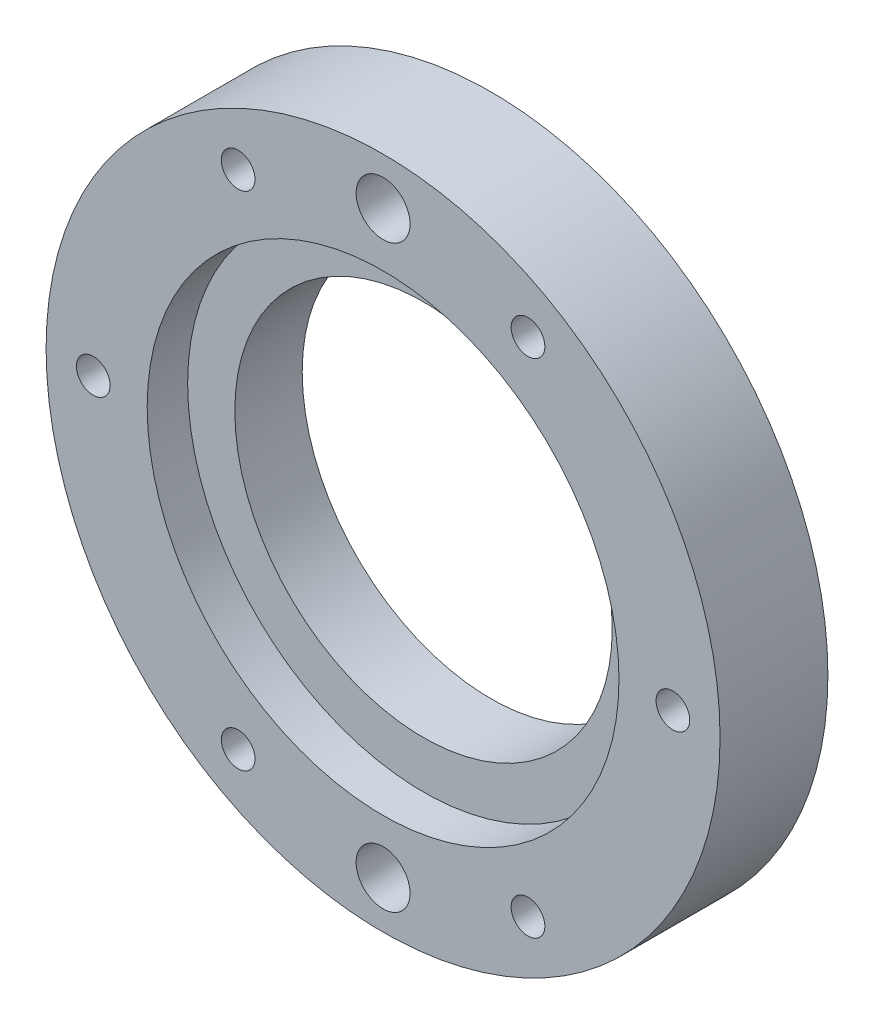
ISO-10303-21;
HEADER;
FILE_DESCRIPTION(('STEP AP214'),'2;1');
FILE_NAME('part.step','',(''),(''),'','','');
FILE_SCHEMA(('AUTOMOTIVE_DESIGN { 1 0 10303 214 1 1 1 1 }'));
ENDSEC;
DATA;
#1=APPLICATION_CONTEXT('core data for automotive mechanical design processes');
#2=APPLICATION_PROTOCOL_DEFINITION('international standard','automotive_design',2000,#1);
#3=PRODUCT_CONTEXT('',#1,'mechanical');
#4=PRODUCT('Part','Part','',(#3));
#5=PRODUCT_RELATED_PRODUCT_CATEGORY('part','',(#4));
#6=PRODUCT_DEFINITION_FORMATION('','',#4);
#7=PRODUCT_DEFINITION_CONTEXT('part definition',#1,'design');
#8=PRODUCT_DEFINITION('design','',#6,#7);
#9=PRODUCT_DEFINITION_SHAPE('','',#8);
#10=(LENGTH_UNIT() NAMED_UNIT(*) SI_UNIT(.MILLI.,.METRE.));
#11=(NAMED_UNIT(*) PLANE_ANGLE_UNIT() SI_UNIT($,.RADIAN.));
#12=(NAMED_UNIT(*) SI_UNIT($,.STERADIAN.) SOLID_ANGLE_UNIT());
#13=UNCERTAINTY_MEASURE_WITH_UNIT(LENGTH_MEASURE(1.E-05),#10,'distance_accuracy_value','');
#14=(GEOMETRIC_REPRESENTATION_CONTEXT(3) GLOBAL_UNCERTAINTY_ASSIGNED_CONTEXT((#13)) GLOBAL_UNIT_ASSIGNED_CONTEXT((#10,
#11,#12)) REPRESENTATION_CONTEXT('',''));
#15=CARTESIAN_POINT('',(0.,0.,0.));
#16=DIRECTION('',(0.,0.,1.));
#17=DIRECTION('',(1.,0.,0.));
#18=AXIS2_PLACEMENT_3D('',#15,#16,#17);
#19=CARTESIAN_POINT('',(0.,-21.5,2.));
#20=DIRECTION('',(0.,0.,1.));
#21=DIRECTION('',(1.,0.,0.));
#22=AXIS2_PLACEMENT_3D('',#19,#20,#21);
#23=PLANE('',#22);
#24=CARTESIAN_POINT('',(0.,-21.5,2.));
#25=DIRECTION('',(0.,0.,1.));
#26=DIRECTION('',(1.,0.,0.));
#27=AXIS2_PLACEMENT_3D('',#24,#25,#26);
#28=CIRCLE('',#27,2.);
#29=CARTESIAN_POINT('',(2.,-21.5,2.));
#30=VERTEX_POINT('',#29);
#31=EDGE_CURVE('E17',#30,#30,#28,.T.);
#32=ORIENTED_EDGE('',*,*,#31,.T.);
#33=EDGE_LOOP('',(#32));
#34=FACE_BOUND('',#33,.T.);
#35=ADVANCED_FACE('F14',(#34),#23,.T.);
#36=CARTESIAN_POINT('',(0.,21.5,2.));
#37=DIRECTION('',(0.,0.,1.));
#38=DIRECTION('',(1.,0.,0.));
#39=AXIS2_PLACEMENT_3D('',#36,#37,#38);
#40=PLANE('',#39);
#41=CARTESIAN_POINT('',(0.,21.5,2.));
#42=DIRECTION('',(0.,0.,1.));
#43=DIRECTION('',(1.,0.,0.));
#44=AXIS2_PLACEMENT_3D('',#41,#42,#43);
#45=CIRCLE('',#44,2.);
#46=CARTESIAN_POINT('',(2.,21.5,2.));
#47=VERTEX_POINT('',#46);
#48=EDGE_CURVE('E81',#47,#47,#45,.T.);
#49=ORIENTED_EDGE('',*,*,#48,.T.);
#50=EDGE_LOOP('',(#49));
#51=FACE_BOUND('',#50,.T.);
#52=ADVANCED_FACE('F92',(#51),#40,.T.);
#53=CARTESIAN_POINT('',(0.,-21.5,2.));
#54=DIRECTION('',(0.,0.,1.));
#55=DIRECTION('',(1.,0.,0.));
#56=AXIS2_PLACEMENT_3D('',#53,#54,#55);
#57=CYLINDRICAL_SURFACE('',#56,2.);
#58=CARTESIAN_POINT('',(0.,-21.5,8.));
#59=DIRECTION('',(0.,0.,1.));
#60=DIRECTION('',(1.,0.,0.));
#61=AXIS2_PLACEMENT_3D('',#58,#59,#60);
#62=CIRCLE('',#61,2.);
#63=CARTESIAN_POINT('',(2.,-21.5,8.));
#64=VERTEX_POINT('',#63);
#65=EDGE_CURVE('E79',#64,#64,#62,.F.);
#66=ORIENTED_EDGE('',*,*,#65,.F.);
#67=EDGE_LOOP('',(#66));
#68=FACE_BOUND('',#67,.T.);
#69=ORIENTED_EDGE('',*,*,#31,.F.);
#70=EDGE_LOOP('',(#69));
#71=FACE_BOUND('',#70,.T.);
#72=ADVANCED_FACE('F89',(#68,#71),#57,.F.);
#73=CARTESIAN_POINT('',(0.,21.5,2.));
#74=DIRECTION('',(0.,0.,1.));
#75=DIRECTION('',(1.,0.,0.));
#76=AXIS2_PLACEMENT_3D('',#73,#74,#75);
#77=CYLINDRICAL_SURFACE('',#76,2.);
#78=CARTESIAN_POINT('',(0.,21.5,8.));
#79=DIRECTION('',(0.,0.,1.));
#80=DIRECTION('',(1.,0.,0.));
#81=AXIS2_PLACEMENT_3D('',#78,#79,#80);
#82=CIRCLE('',#81,2.);
#83=CARTESIAN_POINT('',(2.,21.5,8.));
#84=VERTEX_POINT('',#83);
#85=EDGE_CURVE('E76',#84,#84,#82,.F.);
#86=ORIENTED_EDGE('',*,*,#85,.F.);
#87=EDGE_LOOP('',(#86));
#88=FACE_BOUND('',#87,.T.);
#89=ORIENTED_EDGE('',*,*,#48,.F.);
#90=EDGE_LOOP('',(#89));
#91=FACE_BOUND('',#90,.T.);
#92=ADVANCED_FACE('F91',(#88,#91),#77,.F.);
#93=CARTESIAN_POINT('',(0.,0.,8.));
#94=DIRECTION('',(0.,0.,-1.));
#95=DIRECTION('',(-1.,0.,0.));
#96=AXIS2_PLACEMENT_3D('',#93,#94,#95);
#97=CYLINDRICAL_SURFACE('',#96,17.5);
#98=CARTESIAN_POINT('',(0.,0.,8.));
#99=DIRECTION('',(0.,0.,-1.));
#100=DIRECTION('',(-1.,0.,0.));
#101=AXIS2_PLACEMENT_3D('',#98,#99,#100);
#102=CIRCLE('',#101,17.5);
#103=CARTESIAN_POINT('',(-17.5,0.,8.));
#104=VERTEX_POINT('',#103);
#105=EDGE_CURVE('E73',#104,#104,#102,.T.);
#106=ORIENTED_EDGE('',*,*,#105,.F.);
#107=EDGE_LOOP('',(#106));
#108=FACE_BOUND('',#107,.T.);
#109=CARTESIAN_POINT('',(0.,0.,5.));
#110=DIRECTION('',(0.,0.,-1.));
#111=DIRECTION('',(-1.,0.,0.));
#112=AXIS2_PLACEMENT_3D('',#109,#110,#111);
#113=CIRCLE('',#112,17.5);
#114=CARTESIAN_POINT('',(-17.5,0.,5.));
#115=VERTEX_POINT('',#114);
#116=EDGE_CURVE('E70',#115,#115,#113,.F.);
#117=ORIENTED_EDGE('',*,*,#116,.F.);
#118=EDGE_LOOP('',(#117));
#119=FACE_BOUND('',#118,.T.);
#120=ADVANCED_FACE('F100',(#108,#119),#97,.F.);
#121=CARTESIAN_POINT('',(0.,0.,8.));
#122=DIRECTION('',(0.,0.,1.));
#123=DIRECTION('',(1.,0.,0.));
#124=AXIS2_PLACEMENT_3D('',#121,#122,#123);
#125=PLANE('',#124);
#126=ORIENTED_EDGE('',*,*,#105,.T.);
#127=EDGE_LOOP('',(#126));
#128=FACE_BOUND('',#127,.T.);
#129=CARTESIAN_POINT('',(0.,0.,8.));
#130=DIRECTION('',(0.,0.,-1.));
#131=DIRECTION('',(-1.,0.,0.));
#132=AXIS2_PLACEMENT_3D('',#129,#130,#131);
#133=CIRCLE('',#132,25.);
#134=CARTESIAN_POINT('',(-25.,0.,8.));
#135=VERTEX_POINT('',#134);
#136=EDGE_CURVE('E49',#135,#135,#133,.T.);
#137=ORIENTED_EDGE('',*,*,#136,.F.);
#138=EDGE_LOOP('',(#137));
#139=FACE_BOUND('',#138,.T.);
#140=ORIENTED_EDGE('',*,*,#85,.T.);
#141=EDGE_LOOP('',(#140));
#142=FACE_BOUND('',#141,.T.);
#143=ORIENTED_EDGE('',*,*,#65,.T.);
#144=EDGE_LOOP('',(#143));
#145=FACE_BOUND('',#144,.T.);
#146=CARTESIAN_POINT('',(-21.5,0.,8.));
#147=DIRECTION('',(0.,0.,1.));
#148=DIRECTION('',(1.,0.,0.));
#149=AXIS2_PLACEMENT_3D('',#146,#147,#148);
#150=CIRCLE('',#149,1.24999999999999);
#151=CARTESIAN_POINT('',(-20.25,0.,8.));
#152=VERTEX_POINT('',#151);
#153=EDGE_CURVE('E52',#152,#152,#150,.F.);
#154=ORIENTED_EDGE('',*,*,#153,.T.);
#155=EDGE_LOOP('',(#154));
#156=FACE_BOUND('',#155,.T.);
#157=CARTESIAN_POINT('',(-10.75,-18.6195461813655,8.));
#158=DIRECTION('',(0.,0.,1.));
#159=DIRECTION('',(1.,0.,0.));
#160=AXIS2_PLACEMENT_3D('',#157,#158,#159);
#161=CIRCLE('',#160,1.24999999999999);
#162=CARTESIAN_POINT('',(-9.50000000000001,-18.6195461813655,8.));
#163=VERTEX_POINT('',#162);
#164=EDGE_CURVE('E55',#163,#163,#161,.F.);
#165=ORIENTED_EDGE('',*,*,#164,.T.);
#166=EDGE_LOOP('',(#165));
#167=FACE_BOUND('',#166,.T.);
#168=CARTESIAN_POINT('',(10.75,-18.6195461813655,8.));
#169=DIRECTION('',(0.,0.,1.));
#170=DIRECTION('',(1.,0.,0.));
#171=AXIS2_PLACEMENT_3D('',#168,#169,#170);
#172=CIRCLE('',#171,1.24999999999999);
#173=CARTESIAN_POINT('',(12.,-18.6195461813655,8.));
#174=VERTEX_POINT('',#173);
#175=EDGE_CURVE('E58',#174,#174,#172,.F.);
#176=ORIENTED_EDGE('',*,*,#175,.T.);
#177=EDGE_LOOP('',(#176));
#178=FACE_BOUND('',#177,.T.);
#179=CARTESIAN_POINT('',(21.5,0.,8.));
#180=DIRECTION('',(0.,0.,1.));
#181=DIRECTION('',(1.,0.,0.));
#182=AXIS2_PLACEMENT_3D('',#179,#180,#181);
#183=CIRCLE('',#182,1.24999999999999);
#184=CARTESIAN_POINT('',(22.75,0.,8.));
#185=VERTEX_POINT('',#184);
#186=EDGE_CURVE('E61',#185,#185,#183,.F.);
#187=ORIENTED_EDGE('',*,*,#186,.T.);
#188=EDGE_LOOP('',(#187));
#189=FACE_BOUND('',#188,.T.);
#190=CARTESIAN_POINT('',(10.75,18.6195461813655,8.));
#191=DIRECTION('',(0.,0.,1.));
#192=DIRECTION('',(1.,0.,0.));
#193=AXIS2_PLACEMENT_3D('',#190,#191,#192);
#194=CIRCLE('',#193,1.24999999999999);
#195=CARTESIAN_POINT('',(12.,18.6195461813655,8.));
#196=VERTEX_POINT('',#195);
#197=EDGE_CURVE('E64',#196,#196,#194,.F.);
#198=ORIENTED_EDGE('',*,*,#197,.T.);
#199=EDGE_LOOP('',(#198));
#200=FACE_BOUND('',#199,.T.);
#201=CARTESIAN_POINT('',(-10.75,18.6195461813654,8.));
#202=DIRECTION('',(0.,0.,1.));
#203=DIRECTION('',(1.,0.,0.));
#204=AXIS2_PLACEMENT_3D('',#201,#202,#203);
#205=CIRCLE('',#204,1.24999999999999);
#206=CARTESIAN_POINT('',(-9.50000000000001,18.6195461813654,8.));
#207=VERTEX_POINT('',#206);
#208=EDGE_CURVE('E67',#207,#207,#205,.F.);
#209=ORIENTED_EDGE('',*,*,#208,.T.);
#210=EDGE_LOOP('',(#209));
#211=FACE_BOUND('',#210,.T.);
#212=ADVANCED_FACE('F146',(#128,#139,#142,#145,#156,#167,#178,#189,#200,#211),#125,.T.);
#213=CARTESIAN_POINT('',(0.,0.,5.));
#214=DIRECTION('',(0.,0.,1.));
#215=DIRECTION('',(1.,0.,0.));
#216=AXIS2_PLACEMENT_3D('',#213,#214,#215);
#217=PLANE('',#216);
#218=CARTESIAN_POINT('',(0.,0.,5.));
#219=DIRECTION('',(0.,0.,-1.));
#220=DIRECTION('',(-1.,0.,0.));
#221=AXIS2_PLACEMENT_3D('',#218,#219,#220);
#222=CIRCLE('',#221,14.);
#223=CARTESIAN_POINT('',(-14.,0.,5.));
#224=VERTEX_POINT('',#223);
#225=EDGE_CURVE('E46',#224,#224,#222,.T.);
#226=ORIENTED_EDGE('',*,*,#225,.T.);
#227=EDGE_LOOP('',(#226));
#228=FACE_BOUND('',#227,.T.);
#229=ORIENTED_EDGE('',*,*,#116,.T.);
#230=EDGE_LOOP('',(#229));
#231=FACE_BOUND('',#230,.T.);
#232=ADVANCED_FACE('F142',(#228,#231),#217,.T.);
#233=CARTESIAN_POINT('',(-10.75,18.6195461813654,8.));
#234=DIRECTION('',(0.,0.,1.));
#235=DIRECTION('',(1.,0.,0.));
#236=AXIS2_PLACEMENT_3D('',#233,#234,#235);
#237=CYLINDRICAL_SURFACE('',#236,1.24999999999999);
#238=CARTESIAN_POINT('',(-10.75,18.6195461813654,0.));
#239=DIRECTION('',(0.,0.,1.));
#240=DIRECTION('',(1.,0.,0.));
#241=AXIS2_PLACEMENT_3D('',#238,#239,#240);
#242=CIRCLE('',#241,1.24999999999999);
#243=CARTESIAN_POINT('',(-9.50000000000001,18.6195461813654,0.));
#244=VERTEX_POINT('',#243);
#245=EDGE_CURVE('E43',#244,#244,#242,.F.);
#246=ORIENTED_EDGE('',*,*,#245,.T.);
#247=EDGE_LOOP('',(#246));
#248=FACE_BOUND('',#247,.T.);
#249=ORIENTED_EDGE('',*,*,#208,.F.);
#250=EDGE_LOOP('',(#249));
#251=FACE_BOUND('',#250,.T.);
#252=ADVANCED_FACE('F138',(#248,#251),#237,.F.);
#253=CARTESIAN_POINT('',(10.75,18.6195461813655,8.));
#254=DIRECTION('',(0.,0.,1.));
#255=DIRECTION('',(1.,0.,0.));
#256=AXIS2_PLACEMENT_3D('',#253,#254,#255);
#257=CYLINDRICAL_SURFACE('',#256,1.24999999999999);
#258=CARTESIAN_POINT('',(10.75,18.6195461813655,0.));
#259=DIRECTION('',(0.,0.,1.));
#260=DIRECTION('',(1.,0.,0.));
#261=AXIS2_PLACEMENT_3D('',#258,#259,#260);
#262=CIRCLE('',#261,1.24999999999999);
#263=CARTESIAN_POINT('',(12.,18.6195461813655,0.));
#264=VERTEX_POINT('',#263);
#265=EDGE_CURVE('E40',#264,#264,#262,.F.);
#266=ORIENTED_EDGE('',*,*,#265,.T.);
#267=EDGE_LOOP('',(#266));
#268=FACE_BOUND('',#267,.T.);
#269=ORIENTED_EDGE('',*,*,#197,.F.);
#270=EDGE_LOOP('',(#269));
#271=FACE_BOUND('',#270,.T.);
#272=ADVANCED_FACE('F134',(#268,#271),#257,.F.);
#273=CARTESIAN_POINT('',(21.5,0.,8.));
#274=DIRECTION('',(0.,0.,1.));
#275=DIRECTION('',(1.,0.,0.));
#276=AXIS2_PLACEMENT_3D('',#273,#274,#275);
#277=CYLINDRICAL_SURFACE('',#276,1.24999999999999);
#278=CARTESIAN_POINT('',(21.5,0.,0.));
#279=DIRECTION('',(0.,0.,1.));
#280=DIRECTION('',(1.,0.,0.));
#281=AXIS2_PLACEMENT_3D('',#278,#279,#280);
#282=CIRCLE('',#281,1.24999999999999);
#283=CARTESIAN_POINT('',(22.75,0.,0.));
#284=VERTEX_POINT('',#283);
#285=EDGE_CURVE('E37',#284,#284,#282,.F.);
#286=ORIENTED_EDGE('',*,*,#285,.T.);
#287=EDGE_LOOP('',(#286));
#288=FACE_BOUND('',#287,.T.);
#289=ORIENTED_EDGE('',*,*,#186,.F.);
#290=EDGE_LOOP('',(#289));
#291=FACE_BOUND('',#290,.T.);
#292=ADVANCED_FACE('F130',(#288,#291),#277,.F.);
#293=CARTESIAN_POINT('',(10.75,-18.6195461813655,8.));
#294=DIRECTION('',(0.,0.,1.));
#295=DIRECTION('',(1.,0.,0.));
#296=AXIS2_PLACEMENT_3D('',#293,#294,#295);
#297=CYLINDRICAL_SURFACE('',#296,1.24999999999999);
#298=CARTESIAN_POINT('',(10.75,-18.6195461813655,0.));
#299=DIRECTION('',(0.,0.,1.));
#300=DIRECTION('',(1.,0.,0.));
#301=AXIS2_PLACEMENT_3D('',#298,#299,#300);
#302=CIRCLE('',#301,1.24999999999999);
#303=CARTESIAN_POINT('',(12.,-18.6195461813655,0.));
#304=VERTEX_POINT('',#303);
#305=EDGE_CURVE('E34',#304,#304,#302,.F.);
#306=ORIENTED_EDGE('',*,*,#305,.T.);
#307=EDGE_LOOP('',(#306));
#308=FACE_BOUND('',#307,.T.);
#309=ORIENTED_EDGE('',*,*,#175,.F.);
#310=EDGE_LOOP('',(#309));
#311=FACE_BOUND('',#310,.T.);
#312=ADVANCED_FACE('F126',(#308,#311),#297,.F.);
#313=CARTESIAN_POINT('',(-10.75,-18.6195461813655,8.));
#314=DIRECTION('',(0.,0.,1.));
#315=DIRECTION('',(1.,0.,0.));
#316=AXIS2_PLACEMENT_3D('',#313,#314,#315);
#317=CYLINDRICAL_SURFACE('',#316,1.24999999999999);
#318=CARTESIAN_POINT('',(-10.75,-18.6195461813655,0.));
#319=DIRECTION('',(0.,0.,1.));
#320=DIRECTION('',(1.,0.,0.));
#321=AXIS2_PLACEMENT_3D('',#318,#319,#320);
#322=CIRCLE('',#321,1.24999999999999);
#323=CARTESIAN_POINT('',(-9.50000000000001,-18.6195461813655,0.));
#324=VERTEX_POINT('',#323);
#325=EDGE_CURVE('E31',#324,#324,#322,.F.);
#326=ORIENTED_EDGE('',*,*,#325,.T.);
#327=EDGE_LOOP('',(#326));
#328=FACE_BOUND('',#327,.T.);
#329=ORIENTED_EDGE('',*,*,#164,.F.);
#330=EDGE_LOOP('',(#329));
#331=FACE_BOUND('',#330,.T.);
#332=ADVANCED_FACE('F122',(#328,#331),#317,.F.);
#333=CARTESIAN_POINT('',(-21.5,0.,8.));
#334=DIRECTION('',(0.,0.,1.));
#335=DIRECTION('',(1.,0.,0.));
#336=AXIS2_PLACEMENT_3D('',#333,#334,#335);
#337=CYLINDRICAL_SURFACE('',#336,1.24999999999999);
#338=CARTESIAN_POINT('',(-21.5,0.,0.));
#339=DIRECTION('',(0.,0.,1.));
#340=DIRECTION('',(1.,0.,0.));
#341=AXIS2_PLACEMENT_3D('',#338,#339,#340);
#342=CIRCLE('',#341,1.24999999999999);
#343=CARTESIAN_POINT('',(-20.25,0.,0.));
#344=VERTEX_POINT('',#343);
#345=EDGE_CURVE('E26',#344,#344,#342,.F.);
#346=ORIENTED_EDGE('',*,*,#345,.T.);
#347=EDGE_LOOP('',(#346));
#348=FACE_BOUND('',#347,.T.);
#349=ORIENTED_EDGE('',*,*,#153,.F.);
#350=EDGE_LOOP('',(#349));
#351=FACE_BOUND('',#350,.T.);
#352=ADVANCED_FACE('F118',(#348,#351),#337,.F.);
#353=CARTESIAN_POINT('',(0.,0.,8.));
#354=DIRECTION('',(0.,0.,-1.));
#355=DIRECTION('',(-1.,0.,0.));
#356=AXIS2_PLACEMENT_3D('',#353,#354,#355);
#357=CYLINDRICAL_SURFACE('',#356,25.);
#358=ORIENTED_EDGE('',*,*,#136,.T.);
#359=EDGE_LOOP('',(#358));
#360=FACE_BOUND('',#359,.T.);
#361=CARTESIAN_POINT('',(0.,0.,0.));
#362=DIRECTION('',(0.,0.,-1.));
#363=DIRECTION('',(-1.,0.,0.));
#364=AXIS2_PLACEMENT_3D('',#361,#362,#363);
#365=CIRCLE('',#364,25.);
#366=CARTESIAN_POINT('',(-25.,0.,0.));
#367=VERTEX_POINT('',#366);
#368=EDGE_CURVE('E21',#367,#367,#365,.F.);
#369=ORIENTED_EDGE('',*,*,#368,.T.);
#370=EDGE_LOOP('',(#369));
#371=FACE_BOUND('',#370,.T.);
#372=ADVANCED_FACE('F112',(#360,#371),#357,.T.);
#373=CARTESIAN_POINT('',(0.,0.,5.));
#374=DIRECTION('',(0.,0.,-1.));
#375=DIRECTION('',(-1.,0.,0.));
#376=AXIS2_PLACEMENT_3D('',#373,#374,#375);
#377=CYLINDRICAL_SURFACE('',#376,14.);
#378=CARTESIAN_POINT('',(0.,0.,0.));
#379=DIRECTION('',(0.,0.,-1.));
#380=DIRECTION('',(-1.,0.,0.));
#381=AXIS2_PLACEMENT_3D('',#378,#379,#380);
#382=CIRCLE('',#381,14.);
#383=CARTESIAN_POINT('',(-14.,0.,0.));
#384=VERTEX_POINT('',#383);
#385=EDGE_CURVE('E9',#384,#384,#382,.T.);
#386=ORIENTED_EDGE('',*,*,#385,.T.);
#387=EDGE_LOOP('',(#386));
#388=FACE_BOUND('',#387,.T.);
#389=ORIENTED_EDGE('',*,*,#225,.F.);
#390=EDGE_LOOP('',(#389));
#391=FACE_BOUND('',#390,.T.);
#392=ADVANCED_FACE('F106',(#388,#391),#377,.F.);
#393=CARTESIAN_POINT('',(0.,0.,0.));
#394=DIRECTION('',(0.,0.,1.));
#395=DIRECTION('',(1.,0.,0.));
#396=AXIS2_PLACEMENT_3D('',#393,#394,#395);
#397=PLANE('',#396);
#398=ORIENTED_EDGE('',*,*,#385,.F.);
#399=EDGE_LOOP('',(#398));
#400=FACE_BOUND('',#399,.T.);
#401=ORIENTED_EDGE('',*,*,#368,.F.);
#402=EDGE_LOOP('',(#401));
#403=FACE_BOUND('',#402,.T.);
#404=ORIENTED_EDGE('',*,*,#345,.F.);
#405=EDGE_LOOP('',(#404));
#406=FACE_BOUND('',#405,.T.);
#407=ORIENTED_EDGE('',*,*,#325,.F.);
#408=EDGE_LOOP('',(#407));
#409=FACE_BOUND('',#408,.T.);
#410=ORIENTED_EDGE('',*,*,#305,.F.);
#411=EDGE_LOOP('',(#410));
#412=FACE_BOUND('',#411,.T.);
#413=ORIENTED_EDGE('',*,*,#285,.F.);
#414=EDGE_LOOP('',(#413));
#415=FACE_BOUND('',#414,.T.);
#416=ORIENTED_EDGE('',*,*,#265,.F.);
#417=EDGE_LOOP('',(#416));
#418=FACE_BOUND('',#417,.T.);
#419=ORIENTED_EDGE('',*,*,#245,.F.);
#420=EDGE_LOOP('',(#419));
#421=FACE_BOUND('',#420,.T.);
#422=ADVANCED_FACE('F104',(#400,#403,#406,#409,#412,#415,#418,#421),#397,.F.);
#423=CLOSED_SHELL('',(#35,#52,#72,#92,#120,#212,#232,#252,#272,#292,#312,#332,#352,#372,#392,#422));
#424=MANIFOLD_SOLID_BREP('B1',#423);
#425=ADVANCED_BREP_SHAPE_REPRESENTATION('',(#18,#424),#14);
#426=SHAPE_DEFINITION_REPRESENTATION(#9,#425);
ENDSEC;
END-ISO-10303-21;
